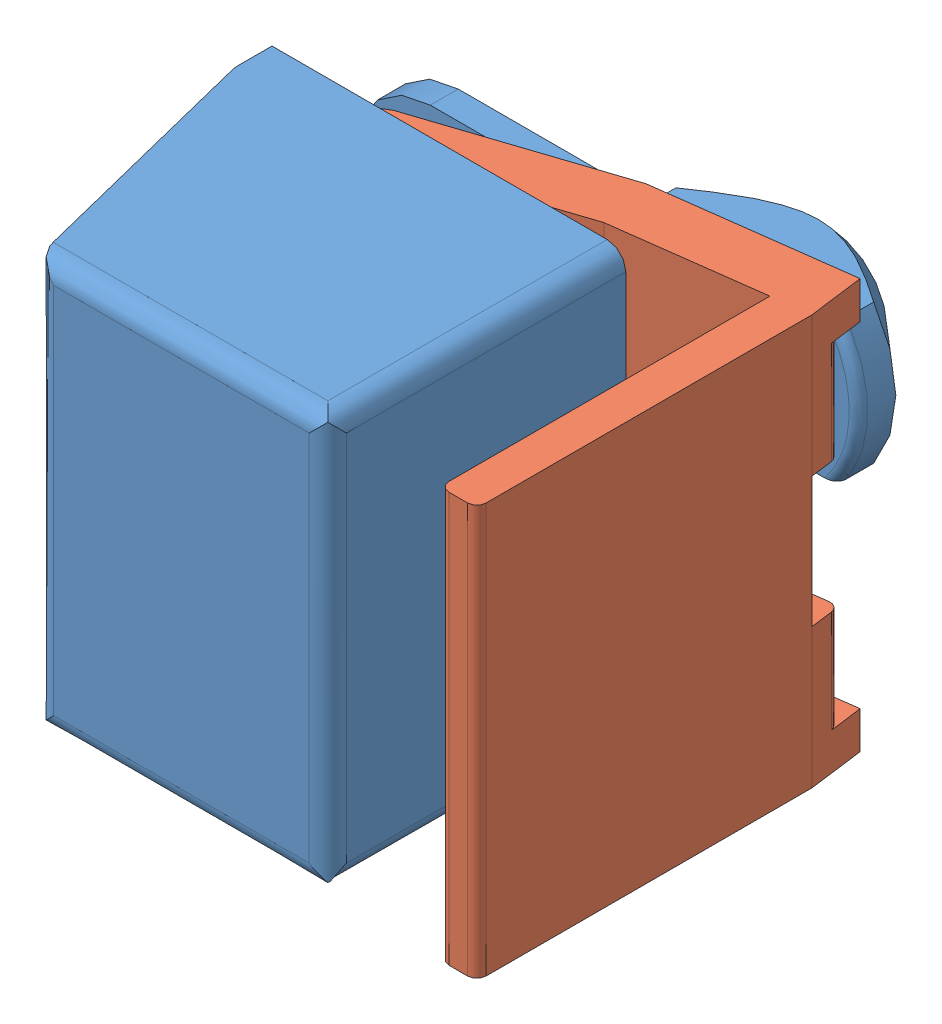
SolidWorks assembly 22.1110_1 PANEL CLAMP BLOCK 32.SLDASM, configuration Default (file format 3800). Lengths in mm.
Overall size (29.32 22 33.01).
2 component instances, 2 part files, 3 mates.
Components (placement in the parent):
- 22.1110_1 PANEL CLAMP BLOCK 32 CATCH-1: 22.1110_1 PANEL CLAMP BLOCK 32 CATCH.SLDPRT [Default] at origin size (22 22 30.5)
- 22.1110_1 PANEL CLAMP BLOCK 32 PRESS ON CLIP-1: 22.1110_1 PANEL CLAMP BLOCK 32 PRESS ON CLIP.SLDPRT [Default] at (-32.2941 0 5.456) x (0.991445 0 -0.130526) z (0.130526 0 0.991445) size (22 22 20.79)
Mates (geometry in assembly coordinates):
- Distance1: distance = 6 mm: plane of 22.1110_1 PANEL CLAMP BLOCK 32 CATCH-1 through (3.5 11 29.5) normal (1 0 0); plane of 22.1110_1 PANEL CLAMP BLOCK 32 PRESS ON CLIP-1 through (9.5 11 12.7633) normal (-1 0 0)
- Coincident4: coincident: plane of 22.1110_1 PANEL CLAMP BLOCK 32 CATCH-1 through (-3.9945 -9 10.4595) normal (0 -1 0); plane of ? through (4.8295 -9 18.7477) normal (0 1 0)
- Coincident5: coincident aligned: plane of 22.1110_1 PANEL CLAMP BLOCK 32 CATCH-1 through (-11.2192 11 30.5) normal (0 0 1); plane of ? through (10 11 32.2727) normal (0 0 1)
